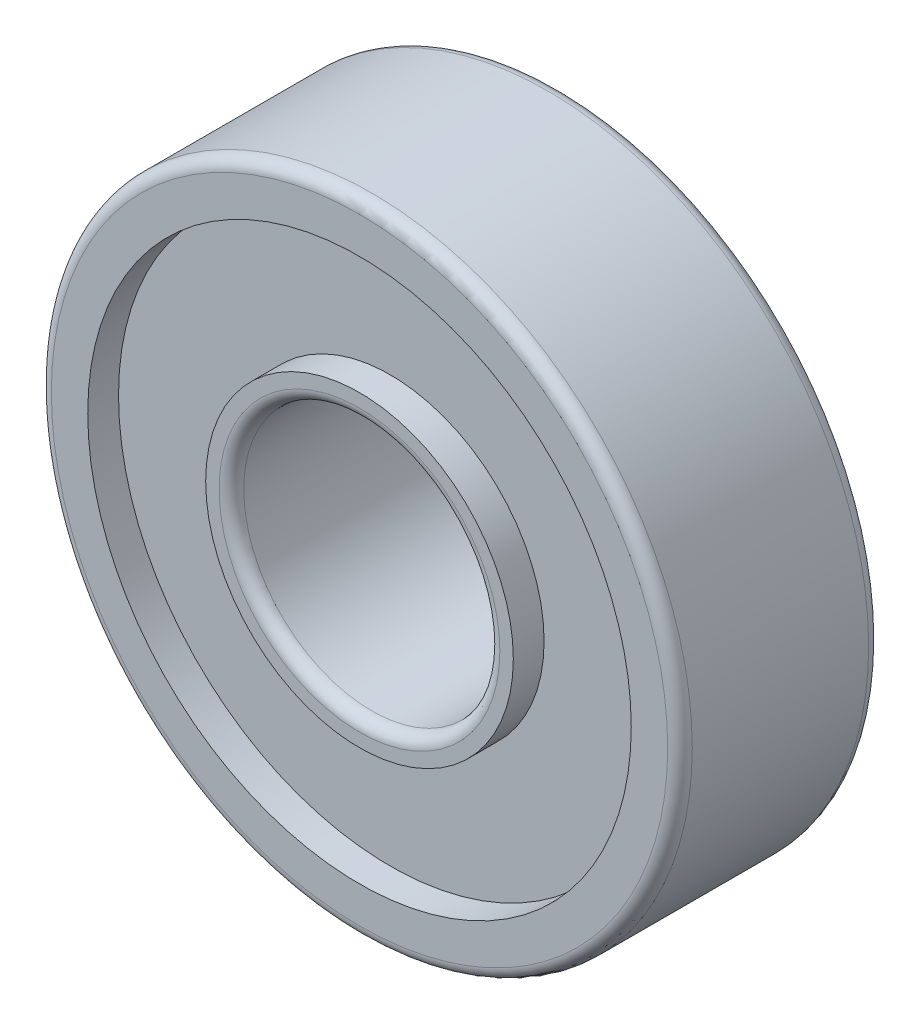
from build123d import *

# Parameters (mm, degrees)
SKETCH1_R          = 7.9375
SKETCH1_R_2        = 3.17246
BASE_EXTRUDE_DEPTH = 4.9784
SKETCH2_R          = 6.731
SKETCH2_R_2        = 3.81
CUT_EXTRUDE1_DEPTH = 0.762
CUT_EXTRUDE2_START = -0.762
SKETCH3_R          = 6.731
SKETCH3_R_2        = 3.81
CUT_EXTRUDE2_DEPTH = 0.762
FILLET1_R          = 0.3048


with BuildPart() as part:
    # Sketch1 → Base-Extrude (new body)
    with BuildSketch(Plane.XY):
        Circle(SKETCH1_R)
        Circle(SKETCH1_R_2, mode=Mode.SUBTRACT)
    extrude(amount=-BASE_EXTRUDE_DEPTH)

    # Sketch2 → Cut-Extrude1 (cut)
    with BuildSketch(Plane.XY):
        Circle(SKETCH2_R)
        Circle(SKETCH2_R_2, mode=Mode.SUBTRACT)
    extrude(amount=-CUT_EXTRUDE1_DEPTH, mode=Mode.SUBTRACT)

    # Sketch3 → Cut-Extrude2 (cut)
    with BuildSketch(Plane(origin=(0, 0, -4.9784), x_dir=(-1, 0, 0), z_dir=(0, 0, -1)).offset(CUT_EXTRUDE2_START)):
        with Locations(Location((0, 0, 0), (0, 0, 180))):
            Circle(SKETCH3_R)
        with Locations(Location((0, 0, 0), (0, 0, 180))):
            Circle(SKETCH3_R_2, mode=Mode.SUBTRACT)
    extrude(amount=CUT_EXTRUDE2_DEPTH, mode=Mode.SUBTRACT)

    # Fillet1
    fillet1_edges = [part.edges().sort_by_distance(p)[0] for p in [
        (-7.9375, 0, 0),
        (-7.9375, 0, -4.9784),
        (-3.17246, 0, -4.9784),
        (-3.17246, 0, 0),
    ]]
    fillet(fillet1_edges, radius=FILLET1_R)


solid = part.part
